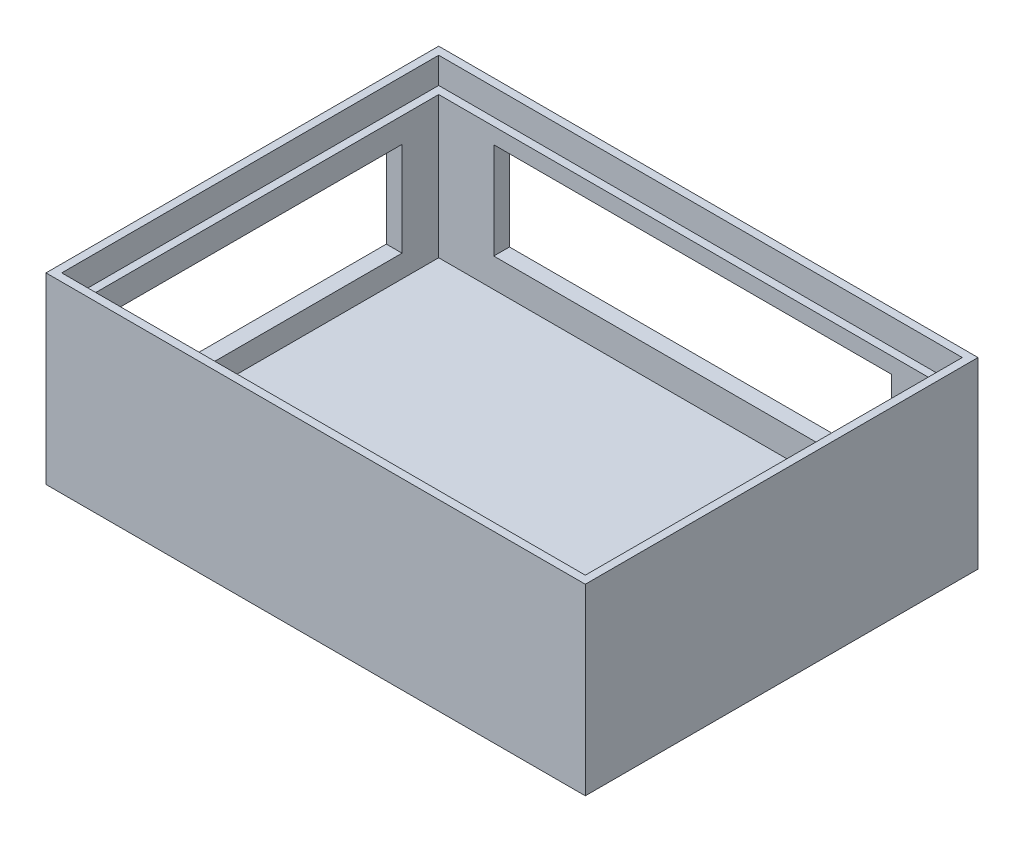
ISO-10303-21;
HEADER;
FILE_DESCRIPTION(('STEP AP214'),'2;1');
FILE_NAME('part.step','',(''),(''),'','','');
FILE_SCHEMA(('AUTOMOTIVE_DESIGN { 1 0 10303 214 1 1 1 1 }'));
ENDSEC;
DATA;
#1=APPLICATION_CONTEXT('core data for automotive mechanical design processes');
#2=APPLICATION_PROTOCOL_DEFINITION('international standard','automotive_design',2000,#1);
#3=PRODUCT_CONTEXT('',#1,'mechanical');
#4=PRODUCT('Part','Part','',(#3));
#5=PRODUCT_RELATED_PRODUCT_CATEGORY('part','',(#4));
#6=PRODUCT_DEFINITION_FORMATION('','',#4);
#7=PRODUCT_DEFINITION_CONTEXT('part definition',#1,'design');
#8=PRODUCT_DEFINITION('design','',#6,#7);
#9=PRODUCT_DEFINITION_SHAPE('','',#8);
#10=(LENGTH_UNIT() NAMED_UNIT(*) SI_UNIT(.MILLI.,.METRE.));
#11=(NAMED_UNIT(*) PLANE_ANGLE_UNIT() SI_UNIT($,.RADIAN.));
#12=(NAMED_UNIT(*) SI_UNIT($,.STERADIAN.) SOLID_ANGLE_UNIT());
#13=UNCERTAINTY_MEASURE_WITH_UNIT(LENGTH_MEASURE(1.E-05),#10,'distance_accuracy_value','');
#14=(GEOMETRIC_REPRESENTATION_CONTEXT(3) GLOBAL_UNCERTAINTY_ASSIGNED_CONTEXT((#13)) GLOBAL_UNIT_ASSIGNED_CONTEXT((#10,
#11,#12)) REPRESENTATION_CONTEXT('',''));
#15=CARTESIAN_POINT('',(0.,0.,0.));
#16=DIRECTION('',(0.,0.,1.));
#17=DIRECTION('',(1.,0.,0.));
#18=AXIS2_PLACEMENT_3D('',#15,#16,#17);
#19=CARTESIAN_POINT('',(0.,35.,0.));
#20=DIRECTION('',(-1.,0.,0.));
#21=DIRECTION('',(0.,0.,1.));
#22=AXIS2_PLACEMENT_3D('',#19,#20,#21);
#23=PLANE('',#22);
#24=DIRECTION('',(0.,0.,-1.));
#25=VECTOR('',#24,1.);
#26=CARTESIAN_POINT('',(0.,0.,0.));
#27=LINE('',#26,#25);
#28=CARTESIAN_POINT('',(0.,0.,0.));
#29=VERTEX_POINT('',#28);
#30=CARTESIAN_POINT('',(0.,0.,-75.));
#31=VERTEX_POINT('',#30);
#32=EDGE_CURVE('E259',#29,#31,#27,.T.);
#33=ORIENTED_EDGE('',*,*,#32,.F.);
#34=DIRECTION('',(0.,-1.,0.));
#35=VECTOR('',#34,1.);
#36=CARTESIAN_POINT('',(0.,35.,0.));
#37=LINE('',#36,#35);
#38=CARTESIAN_POINT('',(0.,35.,0.));
#39=VERTEX_POINT('',#38);
#40=EDGE_CURVE('E295',#39,#29,#37,.T.);
#41=ORIENTED_EDGE('',*,*,#40,.F.);
#42=DIRECTION('',(0.,0.,-1.));
#43=VECTOR('',#42,1.);
#44=CARTESIAN_POINT('',(0.,35.,0.));
#45=LINE('',#44,#43);
#46=CARTESIAN_POINT('',(0.,35.,-75.));
#47=VERTEX_POINT('',#46);
#48=EDGE_CURVE('E274',#39,#47,#45,.T.);
#49=ORIENTED_EDGE('',*,*,#48,.T.);
#50=DIRECTION('',(0.,-1.,0.));
#51=VECTOR('',#50,1.);
#52=CARTESIAN_POINT('',(0.,35.,-75.));
#53=LINE('',#52,#51);
#54=EDGE_CURVE('E285',#47,#31,#53,.T.);
#55=ORIENTED_EDGE('',*,*,#54,.T.);
#56=EDGE_LOOP('',(#33,#41,#49,#55));
#57=FACE_BOUND('',#56,.T.);
#58=DIRECTION('',(0.,0.,1.));
#59=VECTOR('',#58,1.);
#60=CARTESIAN_POINT('',(0.,7.25905820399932,-65.));
#61=LINE('',#60,#59);
#62=CARTESIAN_POINT('',(0.,7.25905820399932,-65.));
#63=VERTEX_POINT('',#62);
#64=CARTESIAN_POINT('',(0.,7.2590582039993,-10.));
#65=VERTEX_POINT('',#64);
#66=EDGE_CURVE('E241',#63,#65,#61,.T.);
#67=ORIENTED_EDGE('',*,*,#66,.F.);
#68=DIRECTION('',(0.,1.,0.));
#69=VECTOR('',#68,1.);
#70=CARTESIAN_POINT('',(0.,7.25905820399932,-65.));
#71=LINE('',#70,#69);
#72=CARTESIAN_POINT('',(0.,25.2590582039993,-65.));
#73=VERTEX_POINT('',#72);
#74=EDGE_CURVE('E226',#63,#73,#71,.T.);
#75=ORIENTED_EDGE('',*,*,#74,.T.);
#76=DIRECTION('',(0.,0.,1.));
#77=VECTOR('',#76,1.);
#78=CARTESIAN_POINT('',(0.,25.2590582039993,-65.));
#79=LINE('',#78,#77);
#80=CARTESIAN_POINT('',(0.,25.2590582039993,-10.));
#81=VERTEX_POINT('',#80);
#82=EDGE_CURVE('E235',#73,#81,#79,.T.);
#83=ORIENTED_EDGE('',*,*,#82,.T.);
#84=DIRECTION('',(0.,1.,0.));
#85=VECTOR('',#84,1.);
#86=CARTESIAN_POINT('',(0.,7.2590582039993,-10.));
#87=LINE('',#86,#85);
#88=EDGE_CURVE('E238',#65,#81,#87,.T.);
#89=ORIENTED_EDGE('',*,*,#88,.F.);
#90=EDGE_LOOP('',(#67,#75,#83,#89));
#91=FACE_BOUND('',#90,.T.);
#92=ADVANCED_FACE('F34',(#57,#91),#23,.T.);
#93=CARTESIAN_POINT('',(3.,35.,0.));
#94=DIRECTION('',(-1.,0.,0.));
#95=DIRECTION('',(0.,0.,1.));
#96=AXIS2_PLACEMENT_3D('',#93,#94,#95);
#97=PLANE('',#96);
#98=DIRECTION('',(0.,-1.,0.));
#99=VECTOR('',#98,1.);
#100=CARTESIAN_POINT('',(2.99999999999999,35.,-72.));
#101=LINE('',#100,#99);
#102=CARTESIAN_POINT('',(2.99999999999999,30.,-72.));
#103=VERTEX_POINT('',#102);
#104=CARTESIAN_POINT('',(2.99999999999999,3.,-72.));
#105=VERTEX_POINT('',#104);
#106=EDGE_CURVE('E261',#103,#105,#101,.T.);
#107=ORIENTED_EDGE('',*,*,#106,.F.);
#108=DIRECTION('',(0.,0.,1.));
#109=VECTOR('',#108,1.);
#110=CARTESIAN_POINT('',(3.,30.,0.));
#111=LINE('',#110,#109);
#112=CARTESIAN_POINT('',(3.,30.,-3.));
#113=VERTEX_POINT('',#112);
#114=EDGE_CURVE('E56',#103,#113,#111,.T.);
#115=ORIENTED_EDGE('',*,*,#114,.T.);
#116=DIRECTION('',(0.,-1.,0.));
#117=VECTOR('',#116,1.);
#118=CARTESIAN_POINT('',(3.,35.,-3.));
#119=LINE('',#118,#117);
#120=CARTESIAN_POINT('',(3.,3.,-3.));
#121=VERTEX_POINT('',#120);
#122=EDGE_CURVE('E257',#113,#121,#119,.T.);
#123=ORIENTED_EDGE('',*,*,#122,.T.);
#124=DIRECTION('',(0.,0.,-1.));
#125=VECTOR('',#124,1.);
#126=CARTESIAN_POINT('',(3.,3.,0.));
#127=LINE('',#126,#125);
#128=EDGE_CURVE('E253',#121,#105,#127,.T.);
#129=ORIENTED_EDGE('',*,*,#128,.T.);
#130=EDGE_LOOP('',(#107,#115,#123,#129));
#131=FACE_BOUND('',#130,.T.);
#132=DIRECTION('',(0.,1.,0.));
#133=VECTOR('',#132,1.);
#134=CARTESIAN_POINT('',(2.99999999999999,35.,-65.));
#135=LINE('',#134,#133);
#136=CARTESIAN_POINT('',(2.99999999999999,7.25905820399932,-65.));
#137=VERTEX_POINT('',#136);
#138=CARTESIAN_POINT('',(2.99999999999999,25.2590582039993,-65.));
#139=VERTEX_POINT('',#138);
#140=EDGE_CURVE('E311',#137,#139,#135,.T.);
#141=ORIENTED_EDGE('',*,*,#140,.F.);
#142=DIRECTION('',(0.,0.,1.));
#143=VECTOR('',#142,1.);
#144=CARTESIAN_POINT('',(3.,7.2590582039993,0.));
#145=LINE('',#144,#143);
#146=CARTESIAN_POINT('',(3.,7.2590582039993,-10.));
#147=VERTEX_POINT('',#146);
#148=EDGE_CURVE('E297',#137,#147,#145,.T.);
#149=ORIENTED_EDGE('',*,*,#148,.T.);
#150=DIRECTION('',(0.,1.,0.));
#151=VECTOR('',#150,1.);
#152=CARTESIAN_POINT('',(3.,35.,-10.));
#153=LINE('',#152,#151);
#154=CARTESIAN_POINT('',(3.,25.2590582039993,-10.));
#155=VERTEX_POINT('',#154);
#156=EDGE_CURVE('E306',#147,#155,#153,.T.);
#157=ORIENTED_EDGE('',*,*,#156,.T.);
#158=DIRECTION('',(0.,0.,1.));
#159=VECTOR('',#158,1.);
#160=CARTESIAN_POINT('',(3.,25.2590582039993,0.));
#161=LINE('',#160,#159);
#162=EDGE_CURVE('E309',#139,#155,#161,.T.);
#163=ORIENTED_EDGE('',*,*,#162,.F.);
#164=EDGE_LOOP('',(#141,#149,#157,#163));
#165=FACE_BOUND('',#164,.T.);
#166=ADVANCED_FACE('F353',(#131,#165),#97,.F.);
#167=CARTESIAN_POINT('',(0.,35.,0.));
#168=DIRECTION('',(0.,0.,-1.));
#169=DIRECTION('',(-1.,0.,0.));
#170=AXIS2_PLACEMENT_3D('',#167,#168,#169);
#171=PLANE('',#170);
#172=DIRECTION('',(1.,0.,0.));
#173=VECTOR('',#172,1.);
#174=CARTESIAN_POINT('',(0.,0.,0.));
#175=LINE('',#174,#173);
#176=CARTESIAN_POINT('',(103.,0.,0.));
#177=VERTEX_POINT('',#176);
#178=EDGE_CURVE('E278',#29,#177,#175,.T.);
#179=ORIENTED_EDGE('',*,*,#178,.T.);
#180=DIRECTION('',(0.,-1.,0.));
#181=VECTOR('',#180,1.);
#182=CARTESIAN_POINT('',(103.,35.,0.));
#183=LINE('',#182,#181);
#184=CARTESIAN_POINT('',(103.,35.,0.));
#185=VERTEX_POINT('',#184);
#186=EDGE_CURVE('E298',#185,#177,#183,.T.);
#187=ORIENTED_EDGE('',*,*,#186,.F.);
#188=DIRECTION('',(1.,0.,0.));
#189=VECTOR('',#188,1.);
#190=CARTESIAN_POINT('',(0.,35.,0.));
#191=LINE('',#190,#189);
#192=EDGE_CURVE('E283',#39,#185,#191,.T.);
#193=ORIENTED_EDGE('',*,*,#192,.F.);
#194=ORIENTED_EDGE('',*,*,#40,.T.);
#195=EDGE_LOOP('',(#179,#187,#193,#194));
#196=FACE_BOUND('',#195,.T.);
#197=ADVANCED_FACE('F358',(#196),#171,.F.);
#198=CARTESIAN_POINT('',(103.,35.,0.));
#199=DIRECTION('',(-1.,0.,0.));
#200=DIRECTION('',(0.,0.,1.));
#201=AXIS2_PLACEMENT_3D('',#198,#199,#200);
#202=PLANE('',#201);
#203=DIRECTION('',(0.,0.,-1.));
#204=VECTOR('',#203,1.);
#205=CARTESIAN_POINT('',(103.,0.,0.));
#206=LINE('',#205,#204);
#207=CARTESIAN_POINT('',(103.,0.,-75.));
#208=VERTEX_POINT('',#207);
#209=EDGE_CURVE('E291',#177,#208,#206,.T.);
#210=ORIENTED_EDGE('',*,*,#209,.T.);
#211=DIRECTION('',(0.,-1.,0.));
#212=VECTOR('',#211,1.);
#213=CARTESIAN_POINT('',(103.,35.,-75.));
#214=LINE('',#213,#212);
#215=CARTESIAN_POINT('',(103.,35.,-75.));
#216=VERTEX_POINT('',#215);
#217=EDGE_CURVE('E301',#216,#208,#214,.T.);
#218=ORIENTED_EDGE('',*,*,#217,.F.);
#219=DIRECTION('',(0.,0.,-1.));
#220=VECTOR('',#219,1.);
#221=CARTESIAN_POINT('',(103.,35.,0.));
#222=LINE('',#221,#220);
#223=EDGE_CURVE('E281',#185,#216,#222,.T.);
#224=ORIENTED_EDGE('',*,*,#223,.F.);
#225=ORIENTED_EDGE('',*,*,#186,.T.);
#226=EDGE_LOOP('',(#210,#218,#224,#225));
#227=FACE_BOUND('',#226,.T.);
#228=ADVANCED_FACE('F417',(#227),#202,.F.);
#229=CARTESIAN_POINT('',(0.,35.,-75.));
#230=DIRECTION('',(0.,0.,-1.));
#231=DIRECTION('',(-1.,0.,0.));
#232=AXIS2_PLACEMENT_3D('',#229,#230,#231);
#233=PLANE('',#232);
#234=DIRECTION('',(0.,-1.,0.));
#235=VECTOR('',#234,1.);
#236=CARTESIAN_POINT('',(89.4824370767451,8.54219898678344,-75.));
#237=LINE('',#236,#235);
#238=CARTESIAN_POINT('',(89.4824370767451,26.9578010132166,-75.));
#239=VERTEX_POINT('',#238);
#240=CARTESIAN_POINT('',(89.4824370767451,8.54219898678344,-75.));
#241=VERTEX_POINT('',#240);
#242=EDGE_CURVE('E212',#239,#241,#237,.T.);
#243=ORIENTED_EDGE('',*,*,#242,.F.);
#244=DIRECTION('',(1.,0.,0.));
#245=VECTOR('',#244,1.);
#246=CARTESIAN_POINT('',(89.4824370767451,26.9578010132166,-75.));
#247=LINE('',#246,#245);
#248=CARTESIAN_POINT('',(13.5175629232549,26.9578010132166,-75.));
#249=VERTEX_POINT('',#248);
#250=EDGE_CURVE('E220',#249,#239,#247,.T.);
#251=ORIENTED_EDGE('',*,*,#250,.F.);
#252=DIRECTION('',(0.,1.,0.));
#253=VECTOR('',#252,1.);
#254=CARTESIAN_POINT('',(13.5175629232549,8.54219898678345,-75.));
#255=LINE('',#254,#253);
#256=CARTESIAN_POINT('',(13.5175629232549,8.54219898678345,-75.));
#257=VERTEX_POINT('',#256);
#258=EDGE_CURVE('E217',#257,#249,#255,.T.);
#259=ORIENTED_EDGE('',*,*,#258,.F.);
#260=DIRECTION('',(-1.,0.,0.));
#261=VECTOR('',#260,1.);
#262=CARTESIAN_POINT('',(89.4824370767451,8.54219898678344,-75.));
#263=LINE('',#262,#261);
#264=EDGE_CURVE('E214',#241,#257,#263,.T.);
#265=ORIENTED_EDGE('',*,*,#264,.F.);
#266=EDGE_LOOP('',(#243,#251,#259,#265));
#267=FACE_BOUND('',#266,.T.);
#268=DIRECTION('',(1.,0.,0.));
#269=VECTOR('',#268,1.);
#270=CARTESIAN_POINT('',(0.,0.,-75.));
#271=LINE('',#270,#269);
#272=EDGE_CURVE('E288',#31,#208,#271,.T.);
#273=ORIENTED_EDGE('',*,*,#272,.F.);
#274=ORIENTED_EDGE('',*,*,#54,.F.);
#275=DIRECTION('',(1.,0.,0.));
#276=VECTOR('',#275,1.);
#277=CARTESIAN_POINT('',(0.,35.,-75.));
#278=LINE('',#277,#276);
#279=EDGE_CURVE('E277',#47,#216,#278,.T.);
#280=ORIENTED_EDGE('',*,*,#279,.T.);
#281=ORIENTED_EDGE('',*,*,#217,.T.);
#282=EDGE_LOOP('',(#273,#274,#280,#281));
#283=FACE_BOUND('',#282,.T.);
#284=ADVANCED_FACE('F337',(#267,#283),#233,.T.);
#285=CARTESIAN_POINT('',(0.,35.,0.));
#286=DIRECTION('',(0.,-1.,0.));
#287=DIRECTION('',(0.,0.,-1.));
#288=AXIS2_PLACEMENT_3D('',#285,#286,#287);
#289=PLANE('',#288);
#290=DIRECTION('',(-1.,0.,0.));
#291=VECTOR('',#290,1.);
#292=CARTESIAN_POINT('',(101.5,35.,-73.5));
#293=LINE('',#292,#291);
#294=CARTESIAN_POINT('',(101.5,35.,-73.5));
#295=VERTEX_POINT('',#294);
#296=CARTESIAN_POINT('',(1.5,35.,-73.5));
#297=VERTEX_POINT('',#296);
#298=EDGE_CURVE('E198',#295,#297,#293,.T.);
#299=ORIENTED_EDGE('',*,*,#298,.F.);
#300=DIRECTION('',(0.,0.,-1.));
#301=VECTOR('',#300,1.);
#302=CARTESIAN_POINT('',(101.5,35.,-73.5));
#303=LINE('',#302,#301);
#304=CARTESIAN_POINT('',(101.5,35.,-1.5));
#305=VERTEX_POINT('',#304);
#306=EDGE_CURVE('E48',#305,#295,#303,.T.);
#307=ORIENTED_EDGE('',*,*,#306,.F.);
#308=DIRECTION('',(1.,0.,0.));
#309=VECTOR('',#308,1.);
#310=CARTESIAN_POINT('',(101.5,35.,-1.5));
#311=LINE('',#310,#309);
#312=CARTESIAN_POINT('',(1.50000000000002,35.,-1.49999999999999));
#313=VERTEX_POINT('',#312);
#314=EDGE_CURVE('E189',#313,#305,#311,.T.);
#315=ORIENTED_EDGE('',*,*,#314,.F.);
#316=DIRECTION('',(0.,0.,1.));
#317=VECTOR('',#316,1.);
#318=CARTESIAN_POINT('',(1.5,35.,-73.5));
#319=LINE('',#318,#317);
#320=EDGE_CURVE('E192',#297,#313,#319,.T.);
#321=ORIENTED_EDGE('',*,*,#320,.F.);
#322=EDGE_LOOP('',(#299,#307,#315,#321));
#323=FACE_BOUND('',#322,.T.);
#324=ORIENTED_EDGE('',*,*,#48,.F.);
#325=ORIENTED_EDGE('',*,*,#192,.T.);
#326=ORIENTED_EDGE('',*,*,#223,.T.);
#327=ORIENTED_EDGE('',*,*,#279,.F.);
#328=EDGE_LOOP('',(#324,#325,#326,#327));
#329=FACE_BOUND('',#328,.T.);
#330=ADVANCED_FACE('F408',(#323,#329),#289,.F.);
#331=CARTESIAN_POINT('',(0.,0.,0.));
#332=DIRECTION('',(0.,-1.,0.));
#333=DIRECTION('',(0.,0.,-1.));
#334=AXIS2_PLACEMENT_3D('',#331,#332,#333);
#335=PLANE('',#334);
#336=ORIENTED_EDGE('',*,*,#32,.T.);
#337=ORIENTED_EDGE('',*,*,#272,.T.);
#338=ORIENTED_EDGE('',*,*,#209,.F.);
#339=ORIENTED_EDGE('',*,*,#178,.F.);
#340=EDGE_LOOP('',(#336,#337,#338,#339));
#341=FACE_BOUND('',#340,.T.);
#342=ADVANCED_FACE('F398',(#341),#335,.T.);
#343=CARTESIAN_POINT('',(0.,35.,-3.));
#344=DIRECTION('',(0.,0.,-1.));
#345=DIRECTION('',(-1.,0.,0.));
#346=AXIS2_PLACEMENT_3D('',#343,#344,#345);
#347=PLANE('',#346);
#348=DIRECTION('',(-1.,0.,0.));
#349=VECTOR('',#348,1.);
#350=CARTESIAN_POINT('',(0.,30.,-3.));
#351=LINE('',#350,#349);
#352=CARTESIAN_POINT('',(100.,30.,-3.));
#353=VERTEX_POINT('',#352);
#354=EDGE_CURVE('E209',#353,#113,#351,.T.);
#355=ORIENTED_EDGE('',*,*,#354,.F.);
#356=DIRECTION('',(0.,-1.,0.));
#357=VECTOR('',#356,1.);
#358=CARTESIAN_POINT('',(100.,35.,-3.));
#359=LINE('',#358,#357);
#360=CARTESIAN_POINT('',(100.,3.,-3.));
#361=VERTEX_POINT('',#360);
#362=EDGE_CURVE('E260',#353,#361,#359,.T.);
#363=ORIENTED_EDGE('',*,*,#362,.T.);
#364=DIRECTION('',(1.,0.,0.));
#365=VECTOR('',#364,1.);
#366=CARTESIAN_POINT('',(0.,3.,-3.));
#367=LINE('',#366,#365);
#368=EDGE_CURVE('E264',#121,#361,#367,.T.);
#369=ORIENTED_EDGE('',*,*,#368,.F.);
#370=ORIENTED_EDGE('',*,*,#122,.F.);
#371=EDGE_LOOP('',(#355,#363,#369,#370));
#372=FACE_BOUND('',#371,.T.);
#373=ADVANCED_FACE('F394',(#372),#347,.T.);
#374=CARTESIAN_POINT('',(100.,35.,0.));
#375=DIRECTION('',(-1.,0.,0.));
#376=DIRECTION('',(0.,0.,1.));
#377=AXIS2_PLACEMENT_3D('',#374,#375,#376);
#378=PLANE('',#377);
#379=DIRECTION('',(0.,0.,1.));
#380=VECTOR('',#379,1.);
#381=CARTESIAN_POINT('',(100.,30.,0.));
#382=LINE('',#381,#380);
#383=CARTESIAN_POINT('',(100.,30.,-72.));
#384=VERTEX_POINT('',#383);
#385=EDGE_CURVE('E204',#384,#353,#382,.T.);
#386=ORIENTED_EDGE('',*,*,#385,.F.);
#387=DIRECTION('',(0.,-1.,0.));
#388=VECTOR('',#387,1.);
#389=CARTESIAN_POINT('',(100.,35.,-72.));
#390=LINE('',#389,#388);
#391=CARTESIAN_POINT('',(100.,3.,-72.));
#392=VERTEX_POINT('',#391);
#393=EDGE_CURVE('E263',#384,#392,#390,.T.);
#394=ORIENTED_EDGE('',*,*,#393,.T.);
#395=DIRECTION('',(0.,0.,-1.));
#396=VECTOR('',#395,1.);
#397=CARTESIAN_POINT('',(100.,3.,0.));
#398=LINE('',#397,#396);
#399=EDGE_CURVE('E267',#361,#392,#398,.T.);
#400=ORIENTED_EDGE('',*,*,#399,.F.);
#401=ORIENTED_EDGE('',*,*,#362,.F.);
#402=EDGE_LOOP('',(#386,#394,#400,#401));
#403=FACE_BOUND('',#402,.T.);
#404=ADVANCED_FACE('F397',(#403),#378,.T.);
#405=CARTESIAN_POINT('',(0.,35.,-72.));
#406=DIRECTION('',(0.,0.,-1.));
#407=DIRECTION('',(-1.,0.,0.));
#408=AXIS2_PLACEMENT_3D('',#405,#406,#407);
#409=PLANE('',#408);
#410=DIRECTION('',(1.,0.,0.));
#411=VECTOR('',#410,1.);
#412=CARTESIAN_POINT('',(0.,26.9578010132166,-72.));
#413=LINE('',#412,#411);
#414=CARTESIAN_POINT('',(13.5175629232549,26.9578010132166,-72.));
#415=VERTEX_POINT('',#414);
#416=CARTESIAN_POINT('',(89.4824370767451,26.9578010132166,-72.));
#417=VERTEX_POINT('',#416);
#418=EDGE_CURVE('E319',#415,#417,#413,.T.);
#419=ORIENTED_EDGE('',*,*,#418,.T.);
#420=DIRECTION('',(0.,-1.,0.));
#421=VECTOR('',#420,1.);
#422=CARTESIAN_POINT('',(89.4824370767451,35.0000000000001,-72.));
#423=LINE('',#422,#421);
#424=CARTESIAN_POINT('',(89.4824370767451,8.54219898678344,-72.));
#425=VERTEX_POINT('',#424);
#426=EDGE_CURVE('E41',#417,#425,#423,.T.);
#427=ORIENTED_EDGE('',*,*,#426,.T.);
#428=DIRECTION('',(-1.,0.,0.));
#429=VECTOR('',#428,1.);
#430=CARTESIAN_POINT('',(0.,8.54219898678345,-72.));
#431=LINE('',#430,#429);
#432=CARTESIAN_POINT('',(13.5175629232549,8.54219898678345,-72.));
#433=VERTEX_POINT('',#432);
#434=EDGE_CURVE('E313',#425,#433,#431,.T.);
#435=ORIENTED_EDGE('',*,*,#434,.T.);
#436=DIRECTION('',(0.,1.,0.));
#437=VECTOR('',#436,1.);
#438=CARTESIAN_POINT('',(13.5175629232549,35.,-72.));
#439=LINE('',#438,#437);
#440=EDGE_CURVE('E316',#433,#415,#439,.T.);
#441=ORIENTED_EDGE('',*,*,#440,.T.);
#442=EDGE_LOOP('',(#419,#427,#435,#441));
#443=FACE_BOUND('',#442,.T.);
#444=ORIENTED_EDGE('',*,*,#393,.F.);
#445=DIRECTION('',(-1.,0.,0.));
#446=VECTOR('',#445,1.);
#447=CARTESIAN_POINT('',(0.,30.,-72.));
#448=LINE('',#447,#446);
#449=EDGE_CURVE('E11',#384,#103,#448,.T.);
#450=ORIENTED_EDGE('',*,*,#449,.T.);
#451=ORIENTED_EDGE('',*,*,#106,.T.);
#452=DIRECTION('',(1.,0.,0.));
#453=VECTOR('',#452,1.);
#454=CARTESIAN_POINT('',(0.,3.,-72.));
#455=LINE('',#454,#453);
#456=EDGE_CURVE('E256',#105,#392,#455,.T.);
#457=ORIENTED_EDGE('',*,*,#456,.T.);
#458=EDGE_LOOP('',(#444,#450,#451,#457));
#459=FACE_BOUND('',#458,.T.);
#460=ADVANCED_FACE('F323',(#443,#459),#409,.F.);
#461=CARTESIAN_POINT('',(0.,3.,0.));
#462=DIRECTION('',(0.,-1.,0.));
#463=DIRECTION('',(0.,0.,-1.));
#464=AXIS2_PLACEMENT_3D('',#461,#462,#463);
#465=PLANE('',#464);
#466=ORIENTED_EDGE('',*,*,#128,.F.);
#467=ORIENTED_EDGE('',*,*,#368,.T.);
#468=ORIENTED_EDGE('',*,*,#399,.T.);
#469=ORIENTED_EDGE('',*,*,#456,.F.);
#470=EDGE_LOOP('',(#466,#467,#468,#469));
#471=FACE_BOUND('',#470,.T.);
#472=ADVANCED_FACE('F392',(#471),#465,.F.);
#473=CARTESIAN_POINT('',(31.,7.25905820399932,-65.));
#474=DIRECTION('',(0.,0.,1.));
#475=DIRECTION('',(0.,-1.,0.));
#476=AXIS2_PLACEMENT_3D('',#473,#474,#475);
#477=PLANE('',#476);
#478=ORIENTED_EDGE('',*,*,#140,.T.);
#479=DIRECTION('',(-1.,0.,0.));
#480=VECTOR('',#479,1.);
#481=CARTESIAN_POINT('',(31.,25.2590582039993,-65.));
#482=LINE('',#481,#480);
#483=EDGE_CURVE('E251',#139,#73,#482,.T.);
#484=ORIENTED_EDGE('',*,*,#483,.T.);
#485=ORIENTED_EDGE('',*,*,#74,.F.);
#486=DIRECTION('',(-1.,0.,0.));
#487=VECTOR('',#486,1.);
#488=CARTESIAN_POINT('',(31.,7.25905820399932,-65.));
#489=LINE('',#488,#487);
#490=EDGE_CURVE('E244',#137,#63,#489,.T.);
#491=ORIENTED_EDGE('',*,*,#490,.F.);
#492=EDGE_LOOP('',(#478,#484,#485,#491));
#493=FACE_BOUND('',#492,.T.);
#494=ADVANCED_FACE('F371',(#493),#477,.T.);
#495=CARTESIAN_POINT('',(31.,25.2590582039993,-65.));
#496=DIRECTION('',(0.,-1.,0.));
#497=DIRECTION('',(0.,0.,-1.));
#498=AXIS2_PLACEMENT_3D('',#495,#496,#497);
#499=PLANE('',#498);
#500=ORIENTED_EDGE('',*,*,#162,.T.);
#501=DIRECTION('',(-1.,0.,0.));
#502=VECTOR('',#501,1.);
#503=CARTESIAN_POINT('',(31.,25.2590582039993,-10.));
#504=LINE('',#503,#502);
#505=EDGE_CURVE('E249',#155,#81,#504,.T.);
#506=ORIENTED_EDGE('',*,*,#505,.T.);
#507=ORIENTED_EDGE('',*,*,#82,.F.);
#508=ORIENTED_EDGE('',*,*,#483,.F.);
#509=EDGE_LOOP('',(#500,#506,#507,#508));
#510=FACE_BOUND('',#509,.T.);
#511=ADVANCED_FACE('F377',(#510),#499,.T.);
#512=CARTESIAN_POINT('',(31.,7.2590582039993,-10.));
#513=DIRECTION('',(0.,0.,1.));
#514=DIRECTION('',(1.,0.,0.));
#515=AXIS2_PLACEMENT_3D('',#512,#513,#514);
#516=PLANE('',#515);
#517=DIRECTION('',(-1.,0.,0.));
#518=VECTOR('',#517,1.);
#519=CARTESIAN_POINT('',(31.,7.2590582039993,-10.));
#520=LINE('',#519,#518);
#521=EDGE_CURVE('E247',#147,#65,#520,.T.);
#522=ORIENTED_EDGE('',*,*,#521,.T.);
#523=ORIENTED_EDGE('',*,*,#88,.T.);
#524=ORIENTED_EDGE('',*,*,#505,.F.);
#525=ORIENTED_EDGE('',*,*,#156,.F.);
#526=EDGE_LOOP('',(#522,#523,#524,#525));
#527=FACE_BOUND('',#526,.T.);
#528=ADVANCED_FACE('F380',(#527),#516,.F.);
#529=CARTESIAN_POINT('',(31.,7.25905820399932,-65.));
#530=DIRECTION('',(0.,-1.,0.));
#531=DIRECTION('',(0.,0.,-1.));
#532=AXIS2_PLACEMENT_3D('',#529,#530,#531);
#533=PLANE('',#532);
#534=ORIENTED_EDGE('',*,*,#490,.T.);
#535=ORIENTED_EDGE('',*,*,#66,.T.);
#536=ORIENTED_EDGE('',*,*,#521,.F.);
#537=ORIENTED_EDGE('',*,*,#148,.F.);
#538=EDGE_LOOP('',(#534,#535,#536,#537));
#539=FACE_BOUND('',#538,.T.);
#540=ADVANCED_FACE('F366',(#539),#533,.F.);
#541=CARTESIAN_POINT('',(89.4824370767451,8.54219898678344,-65.));
#542=DIRECTION('',(1.,0.,0.));
#543=DIRECTION('',(0.,1.,0.));
#544=AXIS2_PLACEMENT_3D('',#541,#542,#543);
#545=PLANE('',#544);
#546=DIRECTION('',(0.,0.,-1.));
#547=VECTOR('',#546,1.);
#548=CARTESIAN_POINT('',(89.4824370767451,26.9578010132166,-65.));
#549=LINE('',#548,#547);
#550=EDGE_CURVE('E224',#417,#239,#549,.T.);
#551=ORIENTED_EDGE('',*,*,#550,.T.);
#552=ORIENTED_EDGE('',*,*,#242,.T.);
#553=DIRECTION('',(0.,0.,-1.));
#554=VECTOR('',#553,1.);
#555=CARTESIAN_POINT('',(89.4824370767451,8.54219898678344,-65.));
#556=LINE('',#555,#554);
#557=EDGE_CURVE('E223',#425,#241,#556,.T.);
#558=ORIENTED_EDGE('',*,*,#557,.F.);
#559=ORIENTED_EDGE('',*,*,#426,.F.);
#560=EDGE_LOOP('',(#551,#552,#558,#559));
#561=FACE_BOUND('',#560,.T.);
#562=ADVANCED_FACE('F328',(#561),#545,.F.);
#563=CARTESIAN_POINT('',(89.4824370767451,26.9578010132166,-65.));
#564=DIRECTION('',(0.,1.,0.));
#565=DIRECTION('',(-1.,0.,0.));
#566=AXIS2_PLACEMENT_3D('',#563,#564,#565);
#567=PLANE('',#566);
#568=DIRECTION('',(0.,0.,-1.));
#569=VECTOR('',#568,1.);
#570=CARTESIAN_POINT('',(13.5175629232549,26.9578010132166,-65.));
#571=LINE('',#570,#569);
#572=EDGE_CURVE('E227',#415,#249,#571,.T.);
#573=ORIENTED_EDGE('',*,*,#572,.T.);
#574=ORIENTED_EDGE('',*,*,#250,.T.);
#575=ORIENTED_EDGE('',*,*,#550,.F.);
#576=ORIENTED_EDGE('',*,*,#418,.F.);
#577=EDGE_LOOP('',(#573,#574,#575,#576));
#578=FACE_BOUND('',#577,.T.);
#579=ADVANCED_FACE('F330',(#578),#567,.F.);
#580=CARTESIAN_POINT('',(13.5175629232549,8.54219898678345,-65.));
#581=DIRECTION('',(-1.,0.,0.));
#582=DIRECTION('',(0.,-1.,0.));
#583=AXIS2_PLACEMENT_3D('',#580,#581,#582);
#584=PLANE('',#583);
#585=DIRECTION('',(0.,0.,-1.));
#586=VECTOR('',#585,1.);
#587=CARTESIAN_POINT('',(13.5175629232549,8.54219898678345,-65.));
#588=LINE('',#587,#586);
#589=EDGE_CURVE('E229',#433,#257,#588,.T.);
#590=ORIENTED_EDGE('',*,*,#589,.T.);
#591=ORIENTED_EDGE('',*,*,#258,.T.);
#592=ORIENTED_EDGE('',*,*,#572,.F.);
#593=ORIENTED_EDGE('',*,*,#440,.F.);
#594=EDGE_LOOP('',(#590,#591,#592,#593));
#595=FACE_BOUND('',#594,.T.);
#596=ADVANCED_FACE('F343',(#595),#584,.F.);
#597=CARTESIAN_POINT('',(89.4824370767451,8.54219898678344,-65.));
#598=DIRECTION('',(0.,-1.,0.));
#599=DIRECTION('',(1.,0.,0.));
#600=AXIS2_PLACEMENT_3D('',#597,#598,#599);
#601=PLANE('',#600);
#602=ORIENTED_EDGE('',*,*,#557,.T.);
#603=ORIENTED_EDGE('',*,*,#264,.T.);
#604=ORIENTED_EDGE('',*,*,#589,.F.);
#605=ORIENTED_EDGE('',*,*,#434,.F.);
#606=EDGE_LOOP('',(#602,#603,#604,#605));
#607=FACE_BOUND('',#606,.T.);
#608=ADVANCED_FACE('F340',(#607),#601,.F.);
#609=CARTESIAN_POINT('',(0.,30.,0.));
#610=DIRECTION('',(0.,-1.,0.));
#611=DIRECTION('',(0.,0.,-1.));
#612=AXIS2_PLACEMENT_3D('',#609,#610,#611);
#613=PLANE('',#612);
#614=DIRECTION('',(0.,0.,-1.));
#615=VECTOR('',#614,1.);
#616=CARTESIAN_POINT('',(101.5,30.,-73.5));
#617=LINE('',#616,#615);
#618=CARTESIAN_POINT('',(101.5,30.,-1.5));
#619=VERTEX_POINT('',#618);
#620=CARTESIAN_POINT('',(101.5,30.,-73.5));
#621=VERTEX_POINT('',#620);
#622=EDGE_CURVE('E171',#619,#621,#617,.T.);
#623=ORIENTED_EDGE('',*,*,#622,.T.);
#624=DIRECTION('',(-1.,0.,0.));
#625=VECTOR('',#624,1.);
#626=CARTESIAN_POINT('',(101.5,30.,-73.5));
#627=LINE('',#626,#625);
#628=CARTESIAN_POINT('',(1.5,30.,-73.5));
#629=VERTEX_POINT('',#628);
#630=EDGE_CURVE('E180',#621,#629,#627,.T.);
#631=ORIENTED_EDGE('',*,*,#630,.T.);
#632=DIRECTION('',(0.,0.,1.));
#633=VECTOR('',#632,1.);
#634=CARTESIAN_POINT('',(1.5,30.,-73.5));
#635=LINE('',#634,#633);
#636=CARTESIAN_POINT('',(1.50000000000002,30.,-1.49999999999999));
#637=VERTEX_POINT('',#636);
#638=EDGE_CURVE('E185',#629,#637,#635,.T.);
#639=ORIENTED_EDGE('',*,*,#638,.T.);
#640=DIRECTION('',(1.,0.,0.));
#641=VECTOR('',#640,1.);
#642=CARTESIAN_POINT('',(101.5,30.,-1.5));
#643=LINE('',#642,#641);
#644=EDGE_CURVE('E177',#637,#619,#643,.T.);
#645=ORIENTED_EDGE('',*,*,#644,.T.);
#646=EDGE_LOOP('',(#623,#631,#639,#645));
#647=FACE_BOUND('',#646,.T.);
#648=ORIENTED_EDGE('',*,*,#449,.F.);
#649=ORIENTED_EDGE('',*,*,#385,.T.);
#650=ORIENTED_EDGE('',*,*,#354,.T.);
#651=ORIENTED_EDGE('',*,*,#114,.F.);
#652=EDGE_LOOP('',(#648,#649,#650,#651));
#653=FACE_BOUND('',#652,.T.);
#654=ADVANCED_FACE('F187',(#647,#653),#613,.F.);
#655=CARTESIAN_POINT('',(101.5,30.,-73.5));
#656=DIRECTION('',(1.,0.,0.));
#657=DIRECTION('',(0.,0.,-1.));
#658=AXIS2_PLACEMENT_3D('',#655,#656,#657);
#659=PLANE('',#658);
#660=ORIENTED_EDGE('',*,*,#306,.T.);
#661=DIRECTION('',(0.,1.,0.));
#662=VECTOR('',#661,1.);
#663=CARTESIAN_POINT('',(101.5,30.,-73.5));
#664=LINE('',#663,#662);
#665=EDGE_CURVE('E167',#621,#295,#664,.T.);
#666=ORIENTED_EDGE('',*,*,#665,.F.);
#667=ORIENTED_EDGE('',*,*,#622,.F.);
#668=DIRECTION('',(0.,1.,0.));
#669=VECTOR('',#668,1.);
#670=CARTESIAN_POINT('',(101.5,30.,-1.5));
#671=LINE('',#670,#669);
#672=EDGE_CURVE('E202',#619,#305,#671,.T.);
#673=ORIENTED_EDGE('',*,*,#672,.T.);
#674=EDGE_LOOP('',(#660,#666,#667,#673));
#675=FACE_BOUND('',#674,.T.);
#676=ADVANCED_FACE('F169',(#675),#659,.F.);
#677=CARTESIAN_POINT('',(101.5,30.,-1.5));
#678=DIRECTION('',(0.,0.,1.));
#679=DIRECTION('',(1.,0.,0.));
#680=AXIS2_PLACEMENT_3D('',#677,#678,#679);
#681=PLANE('',#680);
#682=ORIENTED_EDGE('',*,*,#314,.T.);
#683=ORIENTED_EDGE('',*,*,#672,.F.);
#684=ORIENTED_EDGE('',*,*,#644,.F.);
#685=DIRECTION('',(0.,1.,0.));
#686=VECTOR('',#685,1.);
#687=CARTESIAN_POINT('',(1.50000000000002,30.,-1.49999999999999));
#688=LINE('',#687,#686);
#689=EDGE_CURVE('E205',#637,#313,#688,.T.);
#690=ORIENTED_EDGE('',*,*,#689,.T.);
#691=EDGE_LOOP('',(#682,#683,#684,#690));
#692=FACE_BOUND('',#691,.T.);
#693=ADVANCED_FACE('F539',(#692),#681,.F.);
#694=CARTESIAN_POINT('',(1.5,30.,-73.5));
#695=DIRECTION('',(-1.,0.,0.));
#696=DIRECTION('',(0.,0.,1.));
#697=AXIS2_PLACEMENT_3D('',#694,#695,#696);
#698=PLANE('',#697);
#699=ORIENTED_EDGE('',*,*,#320,.T.);
#700=ORIENTED_EDGE('',*,*,#689,.F.);
#701=ORIENTED_EDGE('',*,*,#638,.F.);
#702=DIRECTION('',(0.,1.,0.));
#703=VECTOR('',#702,1.);
#704=CARTESIAN_POINT('',(1.5,30.,-73.5));
#705=LINE('',#704,#703);
#706=EDGE_CURVE('E176',#629,#297,#705,.T.);
#707=ORIENTED_EDGE('',*,*,#706,.T.);
#708=EDGE_LOOP('',(#699,#700,#701,#707));
#709=FACE_BOUND('',#708,.T.);
#710=ADVANCED_FACE('F546',(#709),#698,.F.);
#711=CARTESIAN_POINT('',(101.5,30.,-73.5));
#712=DIRECTION('',(0.,0.,-1.));
#713=DIRECTION('',(-1.,0.,0.));
#714=AXIS2_PLACEMENT_3D('',#711,#712,#713);
#715=PLANE('',#714);
#716=ORIENTED_EDGE('',*,*,#298,.T.);
#717=ORIENTED_EDGE('',*,*,#706,.F.);
#718=ORIENTED_EDGE('',*,*,#630,.F.);
#719=ORIENTED_EDGE('',*,*,#665,.T.);
#720=EDGE_LOOP('',(#716,#717,#718,#719));
#721=FACE_BOUND('',#720,.T.);
#722=ADVANCED_FACE('F181',(#721),#715,.F.);
#723=CLOSED_SHELL('',(#92,#166,#197,#228,#284,#330,#342,#373,#404,#460,#472,#494,#511,#528,#540,
#562,#579,#596,#608,#654,#676,#693,#710,#722));
#724=MANIFOLD_SOLID_BREP('B2',#723);
#725=ADVANCED_BREP_SHAPE_REPRESENTATION('',(#18,#724),#14);
#726=SHAPE_DEFINITION_REPRESENTATION(#9,#725);
ENDSEC;
END-ISO-10303-21;
